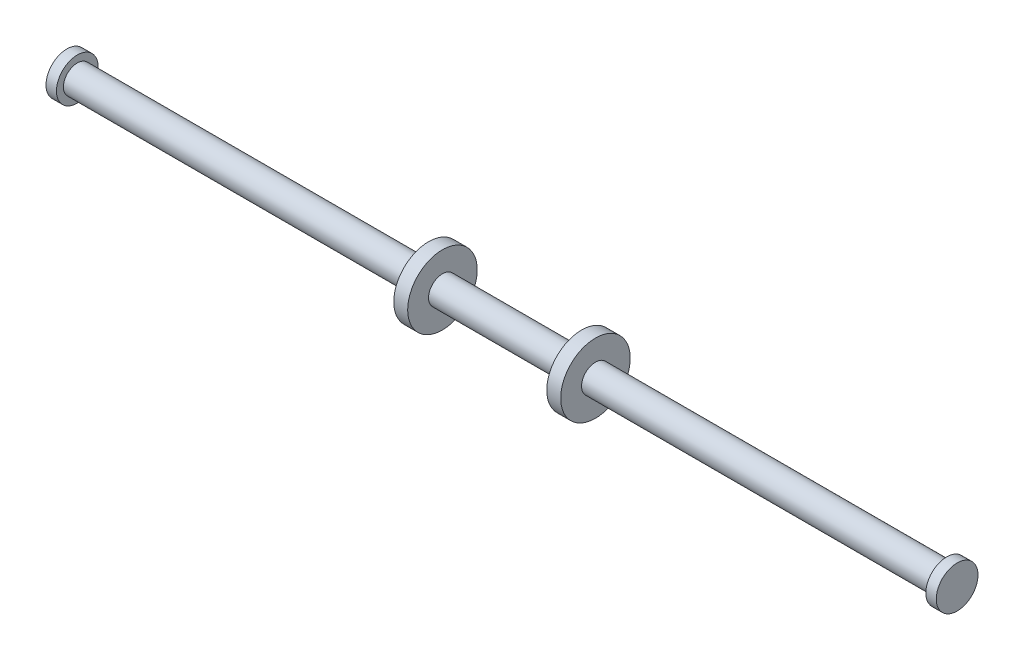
from build123d import *

# Parameters (mm, degrees)
SKETCH1_R           = 2
BOSS_EXTRUDE1_DEPTH = 128
SKETCH2_R           = 3
BOSS_EXTRUDE2_DEPTH = 1.5
BOSS_EXTRUDE3_START = -1.5
SKETCH3_R           = 3
BOSS_EXTRUDE3_DEPTH = 1.5
BOSS_EXTRUDE4_START = -54
SKETCH4_R           = 5
BOSS_EXTRUDE4_DEPTH = 2
BOSS_EXTRUDE5_START = -52
SKETCH5_R           = 5
BOSS_EXTRUDE5_DEPTH = 2


with BuildPart() as part:
    # Sketch1 → Boss-Extrude1 (new body)
    with BuildSketch(Plane(origin=(0, 0, 0), x_dir=(0, 0, -1), z_dir=(1, 0, 0))):
        Circle(SKETCH1_R)
    extrude(amount=BOSS_EXTRUDE1_DEPTH)

    # Sketch2 → Boss-Extrude2 (add)
    with BuildSketch(Plane(origin=(128, 0, 0), x_dir=(0, 0, -1), z_dir=(1, 0, 0))):
        Circle(SKETCH2_R)
    extrude(amount=-BOSS_EXTRUDE2_DEPTH)

    # Sketch3 → Boss-Extrude3 (add)
    with BuildSketch(Plane.ZY.offset(BOSS_EXTRUDE3_START)):
        with Locations(Location((0, 0, 0), (0, 0, 180))):
            Circle(SKETCH3_R)
    extrude(amount=BOSS_EXTRUDE3_DEPTH)

    # Sketch4 → Boss-Extrude4 (add)
    with BuildSketch(Plane.ZY.offset(BOSS_EXTRUDE4_START)):
        Circle(SKETCH4_R)
    extrude(amount=BOSS_EXTRUDE4_DEPTH)

    # Sketch5 → Boss-Extrude5 (add)
    with BuildSketch(Plane(origin=(128, 0, 0), x_dir=(0, 0, -1), z_dir=(1, 0, 0)).offset(BOSS_EXTRUDE5_START)):
        with Locations(Location((0, 0, 0), (0, 0, 180))):
            Circle(SKETCH5_R)
    extrude(amount=-BOSS_EXTRUDE5_DEPTH)


solid = part.part
